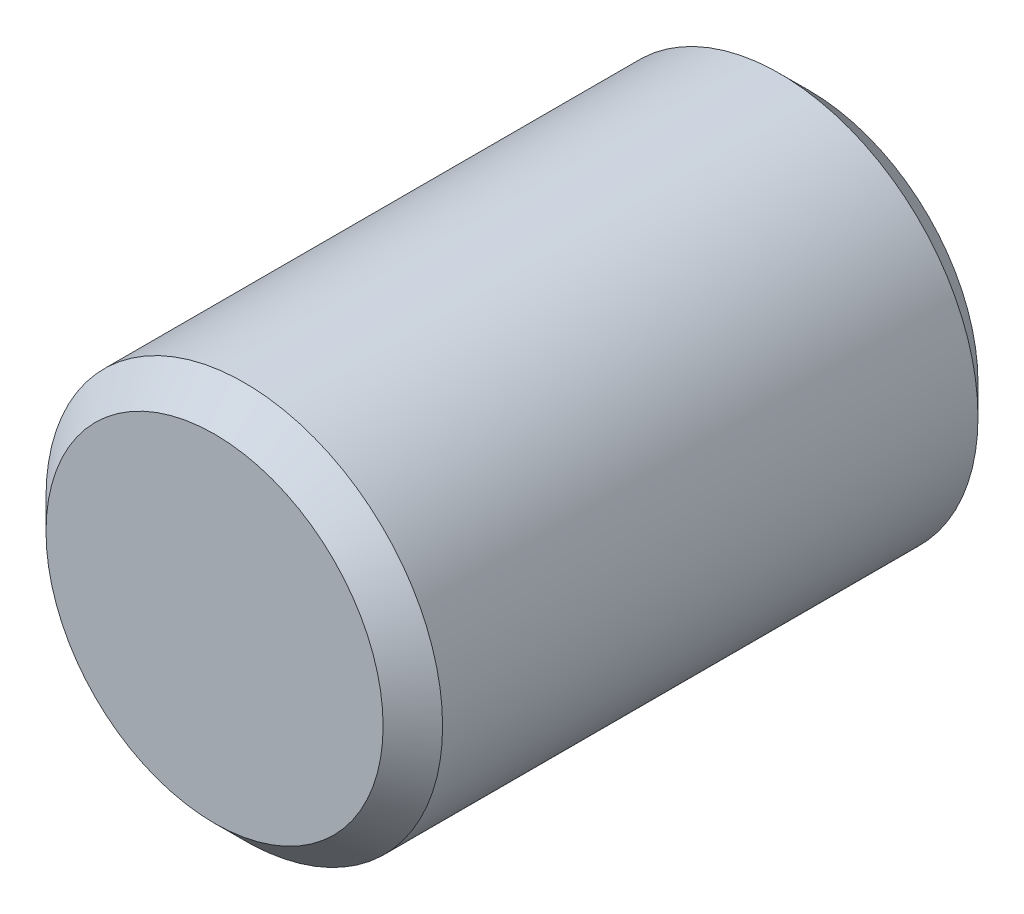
ISO-10303-21;
HEADER;
FILE_DESCRIPTION(('STEP AP214'),'2;1');
FILE_NAME('part.step','',(''),(''),'','','');
FILE_SCHEMA(('AUTOMOTIVE_DESIGN { 1 0 10303 214 1 1 1 1 }'));
ENDSEC;
DATA;
#1=APPLICATION_CONTEXT('core data for automotive mechanical design processes');
#2=APPLICATION_PROTOCOL_DEFINITION('international standard','automotive_design',2000,#1);
#3=PRODUCT_CONTEXT('',#1,'mechanical');
#4=PRODUCT('Part','Part','',(#3));
#5=PRODUCT_RELATED_PRODUCT_CATEGORY('part','',(#4));
#6=PRODUCT_DEFINITION_FORMATION('','',#4);
#7=PRODUCT_DEFINITION_CONTEXT('part definition',#1,'design');
#8=PRODUCT_DEFINITION('design','',#6,#7);
#9=PRODUCT_DEFINITION_SHAPE('','',#8);
#10=(LENGTH_UNIT() NAMED_UNIT(*) SI_UNIT(.MILLI.,.METRE.));
#11=(NAMED_UNIT(*) PLANE_ANGLE_UNIT() SI_UNIT($,.RADIAN.));
#12=(NAMED_UNIT(*) SI_UNIT($,.STERADIAN.) SOLID_ANGLE_UNIT());
#13=UNCERTAINTY_MEASURE_WITH_UNIT(LENGTH_MEASURE(1.E-05),#10,'distance_accuracy_value','');
#14=(GEOMETRIC_REPRESENTATION_CONTEXT(3) GLOBAL_UNCERTAINTY_ASSIGNED_CONTEXT((#13)) GLOBAL_UNIT_ASSIGNED_CONTEXT((#10,
#11,#12)) REPRESENTATION_CONTEXT('',''));
#15=CARTESIAN_POINT('',(0.,0.,0.));
#16=DIRECTION('',(0.,0.,1.));
#17=DIRECTION('',(1.,0.,0.));
#18=AXIS2_PLACEMENT_3D('',#15,#16,#17);
#19=CARTESIAN_POINT('',(0.,0.,12.));
#20=DIRECTION('',(0.,0.,-1.));
#21=DIRECTION('',(-1.,0.,0.));
#22=AXIS2_PLACEMENT_3D('',#19,#20,#21);
#23=CYLINDRICAL_SURFACE('',#22,4.);
#24=CARTESIAN_POINT('',(0.,0.,11.4));
#25=DIRECTION('',(0.,0.,1.));
#26=DIRECTION('',(1.,0.,0.));
#27=AXIS2_PLACEMENT_3D('',#24,#25,#26);
#28=CIRCLE('',#27,4.);
#29=CARTESIAN_POINT('',(4.,0.,11.4));
#30=VERTEX_POINT('',#29);
#31=EDGE_CURVE('E8',#30,#30,#28,.F.);
#32=ORIENTED_EDGE('',*,*,#31,.T.);
#33=EDGE_LOOP('',(#32));
#34=FACE_BOUND('',#33,.T.);
#35=CARTESIAN_POINT('',(0.,0.,0.6));
#36=DIRECTION('',(0.,0.,1.));
#37=DIRECTION('',(1.,0.,0.));
#38=AXIS2_PLACEMENT_3D('',#35,#36,#37);
#39=CIRCLE('',#38,4.);
#40=CARTESIAN_POINT('',(4.,0.,0.6));
#41=VERTEX_POINT('',#40);
#42=EDGE_CURVE('E26',#41,#41,#39,.T.);
#43=ORIENTED_EDGE('',*,*,#42,.T.);
#44=EDGE_LOOP('',(#43));
#45=FACE_BOUND('',#44,.T.);
#46=ADVANCED_FACE('F12',(#34,#45),#23,.T.);
#47=CARTESIAN_POINT('',(0.,0.,12.));
#48=DIRECTION('',(0.,0.,1.));
#49=DIRECTION('',(1.,0.,0.));
#50=AXIS2_PLACEMENT_3D('',#47,#48,#49);
#51=PLANE('',#50);
#52=CARTESIAN_POINT('',(0.,0.,12.));
#53=DIRECTION('',(0.,0.,1.));
#54=DIRECTION('',(1.,0.,0.));
#55=AXIS2_PLACEMENT_3D('',#52,#53,#54);
#56=CIRCLE('',#55,3.4);
#57=CARTESIAN_POINT('',(3.4,0.,12.));
#58=VERTEX_POINT('',#57);
#59=EDGE_CURVE('E18',#58,#58,#56,.T.);
#60=ORIENTED_EDGE('',*,*,#59,.T.);
#61=EDGE_LOOP('',(#60));
#62=FACE_BOUND('',#61,.T.);
#63=ADVANCED_FACE('F60',(#62),#51,.T.);
#64=CARTESIAN_POINT('',(0.,0.,0.));
#65=DIRECTION('',(0.,0.,1.));
#66=DIRECTION('',(1.,0.,0.));
#67=AXIS2_PLACEMENT_3D('',#64,#65,#66);
#68=PLANE('',#67);
#69=CARTESIAN_POINT('',(0.,0.,0.));
#70=DIRECTION('',(0.,0.,-1.));
#71=DIRECTION('',(0.,1.,0.));
#72=AXIS2_PLACEMENT_3D('',#69,#70,#71);
#73=CIRCLE('',#72,1.75);
#74=CARTESIAN_POINT('',(0.,1.75,0.));
#75=VERTEX_POINT('',#74);
#76=EDGE_CURVE('E31',#75,#75,#73,.T.);
#77=ORIENTED_EDGE('',*,*,#76,.F.);
#78=EDGE_LOOP('',(#77));
#79=FACE_BOUND('',#78,.T.);
#80=CARTESIAN_POINT('',(0.,0.,0.));
#81=DIRECTION('',(0.,0.,1.));
#82=DIRECTION('',(1.,0.,0.));
#83=AXIS2_PLACEMENT_3D('',#80,#81,#82);
#84=CIRCLE('',#83,3.4);
#85=CARTESIAN_POINT('',(3.4,0.,0.));
#86=VERTEX_POINT('',#85);
#87=EDGE_CURVE('E22',#86,#86,#84,.F.);
#88=ORIENTED_EDGE('',*,*,#87,.T.);
#89=EDGE_LOOP('',(#88));
#90=FACE_BOUND('',#89,.T.);
#91=ADVANCED_FACE('F56',(#79,#90),#68,.F.);
#92=CARTESIAN_POINT('',(0.,0.,0.6));
#93=DIRECTION('',(0.,0.,1.));
#94=DIRECTION('',(1.,0.,0.));
#95=AXIS2_PLACEMENT_3D('',#92,#93,#94);
#96=CONICAL_SURFACE('',#95,4.,0.78539816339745);
#97=ORIENTED_EDGE('',*,*,#87,.F.);
#98=EDGE_LOOP('',(#97));
#99=FACE_BOUND('',#98,.T.);
#100=ORIENTED_EDGE('',*,*,#42,.F.);
#101=EDGE_LOOP('',(#100));
#102=FACE_BOUND('',#101,.T.);
#103=ADVANCED_FACE('F59',(#99,#102),#96,.T.);
#104=CARTESIAN_POINT('',(0.,0.,12.));
#105=DIRECTION('',(0.,0.,-1.));
#106=DIRECTION('',(-1.,0.,0.));
#107=AXIS2_PLACEMENT_3D('',#104,#105,#106);
#108=CONICAL_SURFACE('',#107,3.4,0.785398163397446);
#109=ORIENTED_EDGE('',*,*,#31,.F.);
#110=EDGE_LOOP('',(#109));
#111=FACE_BOUND('',#110,.T.);
#112=ORIENTED_EDGE('',*,*,#59,.F.);
#113=EDGE_LOOP('',(#112));
#114=FACE_BOUND('',#113,.T.);
#115=ADVANCED_FACE('F52',(#111,#114),#108,.T.);
#116=CARTESIAN_POINT('',(0.,0.,0.));
#117=DIRECTION('',(0.,0.,-1.));
#118=DIRECTION('',(0.,1.,0.));
#119=AXIS2_PLACEMENT_3D('',#116,#117,#118);
#120=CONICAL_SURFACE('',#119,1.75,0.785398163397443);
#121=CARTESIAN_POINT('',(0.,0.,0.25));
#122=DIRECTION('',(0.,0.,-1.));
#123=DIRECTION('',(0.,1.,0.));
#124=AXIS2_PLACEMENT_3D('',#121,#122,#123);
#125=CIRCLE('',#124,1.5);
#126=CARTESIAN_POINT('',(0.,1.5,0.25));
#127=VERTEX_POINT('',#126);
#128=EDGE_CURVE('E34',#127,#127,#125,.T.);
#129=ORIENTED_EDGE('',*,*,#128,.F.);
#130=EDGE_LOOP('',(#129));
#131=FACE_BOUND('',#130,.T.);
#132=ORIENTED_EDGE('',*,*,#76,.T.);
#133=EDGE_LOOP('',(#132));
#134=FACE_BOUND('',#133,.T.);
#135=ADVANCED_FACE('F46',(#131,#134),#120,.F.);
#136=CARTESIAN_POINT('',(0.,0.,0.));
#137=DIRECTION('',(0.,0.,-1.));
#138=DIRECTION('',(0.,1.,0.));
#139=AXIS2_PLACEMENT_3D('',#136,#137,#138);
#140=CYLINDRICAL_SURFACE('',#139,1.5);
#141=CARTESIAN_POINT('',(0.,0.,6.));
#142=DIRECTION('',(0.,0.,-1.));
#143=DIRECTION('',(0.,1.,0.));
#144=AXIS2_PLACEMENT_3D('',#141,#142,#143);
#145=CIRCLE('',#144,1.5);
#146=CARTESIAN_POINT('',(0.,1.5,6.));
#147=VERTEX_POINT('',#146);
#148=EDGE_CURVE('E37',#147,#147,#145,.T.);
#149=ORIENTED_EDGE('',*,*,#148,.F.);
#150=EDGE_LOOP('',(#149));
#151=FACE_BOUND('',#150,.T.);
#152=ORIENTED_EDGE('',*,*,#128,.T.);
#153=EDGE_LOOP('',(#152));
#154=FACE_BOUND('',#153,.T.);
#155=ADVANCED_FACE('F43',(#151,#154),#140,.F.);
#156=CARTESIAN_POINT('',(1.25,0.,6.));
#157=DIRECTION('',(0.,0.,1.));
#158=DIRECTION('',(0.,-1.,0.));
#159=AXIS2_PLACEMENT_3D('',#156,#157,#158);
#160=PLANE('',#159);
#161=ORIENTED_EDGE('',*,*,#148,.T.);
#162=EDGE_LOOP('',(#161));
#163=FACE_BOUND('',#162,.T.);
#164=ADVANCED_FACE('F41',(#163),#160,.F.);
#165=CLOSED_SHELL('',(#46,#63,#91,#103,#115,#135,#155,#164));
#166=MANIFOLD_SOLID_BREP('B1',#165);
#167=ADVANCED_BREP_SHAPE_REPRESENTATION('',(#18,#166),#14);
#168=SHAPE_DEFINITION_REPRESENTATION(#9,#167);
ENDSEC;
END-ISO-10303-21;
